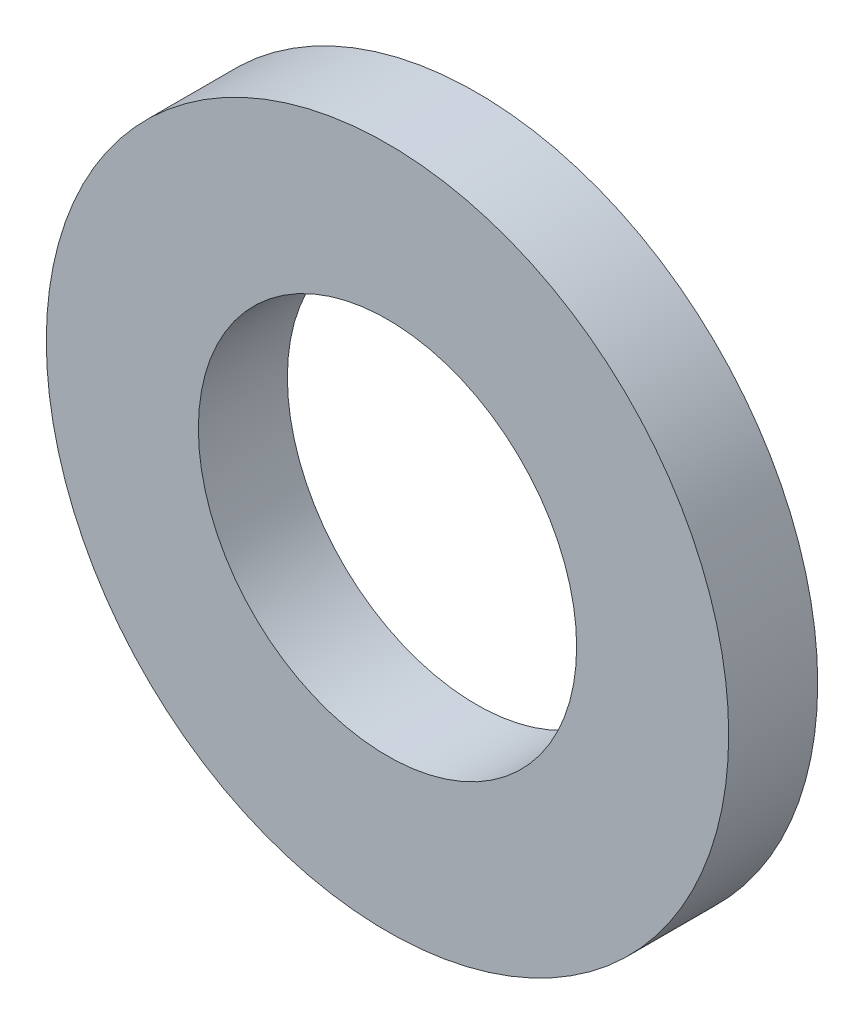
ISO-10303-21;
HEADER;
FILE_DESCRIPTION(('STEP AP214'),'2;1');
FILE_NAME('part.step','',(''),(''),'','','');
FILE_SCHEMA(('AUTOMOTIVE_DESIGN { 1 0 10303 214 1 1 1 1 }'));
ENDSEC;
DATA;
#1=APPLICATION_CONTEXT('core data for automotive mechanical design processes');
#2=APPLICATION_PROTOCOL_DEFINITION('international standard','automotive_design',2000,#1);
#3=PRODUCT_CONTEXT('',#1,'mechanical');
#4=PRODUCT('Part','Part','',(#3));
#5=PRODUCT_RELATED_PRODUCT_CATEGORY('part','',(#4));
#6=PRODUCT_DEFINITION_FORMATION('','',#4);
#7=PRODUCT_DEFINITION_CONTEXT('part definition',#1,'design');
#8=PRODUCT_DEFINITION('design','',#6,#7);
#9=PRODUCT_DEFINITION_SHAPE('','',#8);
#10=(LENGTH_UNIT() NAMED_UNIT(*) SI_UNIT(.MILLI.,.METRE.));
#11=(NAMED_UNIT(*) PLANE_ANGLE_UNIT() SI_UNIT($,.RADIAN.));
#12=(NAMED_UNIT(*) SI_UNIT($,.STERADIAN.) SOLID_ANGLE_UNIT());
#13=UNCERTAINTY_MEASURE_WITH_UNIT(LENGTH_MEASURE(1.E-05),#10,'distance_accuracy_value','');
#14=(GEOMETRIC_REPRESENTATION_CONTEXT(3) GLOBAL_UNCERTAINTY_ASSIGNED_CONTEXT((#13)) GLOBAL_UNIT_ASSIGNED_CONTEXT((#10,
#11,#12)) REPRESENTATION_CONTEXT('',''));
#15=CARTESIAN_POINT('',(0.,0.,0.));
#16=DIRECTION('',(0.,0.,1.));
#17=DIRECTION('',(1.,0.,0.));
#18=AXIS2_PLACEMENT_3D('',#15,#16,#17);
#19=CARTESIAN_POINT('',(0.,0.,1.2));
#20=DIRECTION('',(0.,0.,1.));
#21=DIRECTION('',(1.,0.,0.));
#22=AXIS2_PLACEMENT_3D('',#19,#20,#21);
#23=PLANE('',#22);
#24=CARTESIAN_POINT('',(0.,0.,1.2));
#25=DIRECTION('',(0.,0.,1.));
#26=DIRECTION('',(1.,0.,0.));
#27=AXIS2_PLACEMENT_3D('',#24,#25,#26);
#28=CIRCLE('',#27,4.6);
#29=CARTESIAN_POINT('',(4.6,0.,1.2));
#30=VERTEX_POINT('',#29);
#31=EDGE_CURVE('E10',#30,#30,#28,.T.);
#32=ORIENTED_EDGE('',*,*,#31,.T.);
#33=EDGE_LOOP('',(#32));
#34=FACE_BOUND('',#33,.T.);
#35=CARTESIAN_POINT('',(0.,0.,1.2));
#36=DIRECTION('',(0.,0.,1.));
#37=DIRECTION('',(1.,0.,0.));
#38=AXIS2_PLACEMENT_3D('',#35,#36,#37);
#39=CIRCLE('',#38,2.55);
#40=CARTESIAN_POINT('',(2.55,0.,1.2));
#41=VERTEX_POINT('',#40);
#42=EDGE_CURVE('E38',#41,#41,#39,.T.);
#43=ORIENTED_EDGE('',*,*,#42,.F.);
#44=EDGE_LOOP('',(#43));
#45=FACE_BOUND('',#44,.T.);
#46=ADVANCED_FACE('F27',(#34,#45),#23,.T.);
#47=CARTESIAN_POINT('',(0.,0.,0.));
#48=DIRECTION('',(0.,0.,1.));
#49=DIRECTION('',(1.,0.,0.));
#50=AXIS2_PLACEMENT_3D('',#47,#48,#49);
#51=PLANE('',#50);
#52=CARTESIAN_POINT('',(0.,0.,0.));
#53=DIRECTION('',(0.,0.,1.));
#54=DIRECTION('',(1.,0.,0.));
#55=AXIS2_PLACEMENT_3D('',#52,#53,#54);
#56=CIRCLE('',#55,4.6);
#57=CARTESIAN_POINT('',(4.6,0.,0.));
#58=VERTEX_POINT('',#57);
#59=EDGE_CURVE('E34',#58,#58,#56,.T.);
#60=ORIENTED_EDGE('',*,*,#59,.F.);
#61=EDGE_LOOP('',(#60));
#62=FACE_BOUND('',#61,.T.);
#63=CARTESIAN_POINT('',(0.,0.,0.));
#64=DIRECTION('',(0.,0.,1.));
#65=DIRECTION('',(1.,0.,0.));
#66=AXIS2_PLACEMENT_3D('',#63,#64,#65);
#67=CIRCLE('',#66,2.55);
#68=CARTESIAN_POINT('',(2.55,0.,0.));
#69=VERTEX_POINT('',#68);
#70=EDGE_CURVE('E42',#69,#69,#67,.T.);
#71=ORIENTED_EDGE('',*,*,#70,.T.);
#72=EDGE_LOOP('',(#71));
#73=FACE_BOUND('',#72,.T.);
#74=ADVANCED_FACE('F48',(#62,#73),#51,.F.);
#75=CARTESIAN_POINT('',(0.,0.,1.2));
#76=DIRECTION('',(0.,0.,-1.));
#77=DIRECTION('',(-1.,0.,0.));
#78=AXIS2_PLACEMENT_3D('',#75,#76,#77);
#79=CYLINDRICAL_SURFACE('',#78,4.6);
#80=ORIENTED_EDGE('',*,*,#31,.F.);
#81=EDGE_LOOP('',(#80));
#82=FACE_BOUND('',#81,.T.);
#83=ORIENTED_EDGE('',*,*,#59,.T.);
#84=EDGE_LOOP('',(#83));
#85=FACE_BOUND('',#84,.T.);
#86=ADVANCED_FACE('F29',(#82,#85),#79,.T.);
#87=CARTESIAN_POINT('',(0.,0.,1.2));
#88=DIRECTION('',(0.,0.,-1.));
#89=DIRECTION('',(-1.,0.,0.));
#90=AXIS2_PLACEMENT_3D('',#87,#88,#89);
#91=CYLINDRICAL_SURFACE('',#90,2.55);
#92=ORIENTED_EDGE('',*,*,#42,.T.);
#93=EDGE_LOOP('',(#92));
#94=FACE_BOUND('',#93,.T.);
#95=ORIENTED_EDGE('',*,*,#70,.F.);
#96=EDGE_LOOP('',(#95));
#97=FACE_BOUND('',#96,.T.);
#98=ADVANCED_FACE('F50',(#94,#97),#91,.F.);
#99=CLOSED_SHELL('',(#46,#74,#86,#98));
#100=MANIFOLD_SOLID_BREP('B2',#99);
#101=ADVANCED_BREP_SHAPE_REPRESENTATION('',(#18,#100),#14);
#102=SHAPE_DEFINITION_REPRESENTATION(#9,#101);
ENDSEC;
END-ISO-10303-21;
